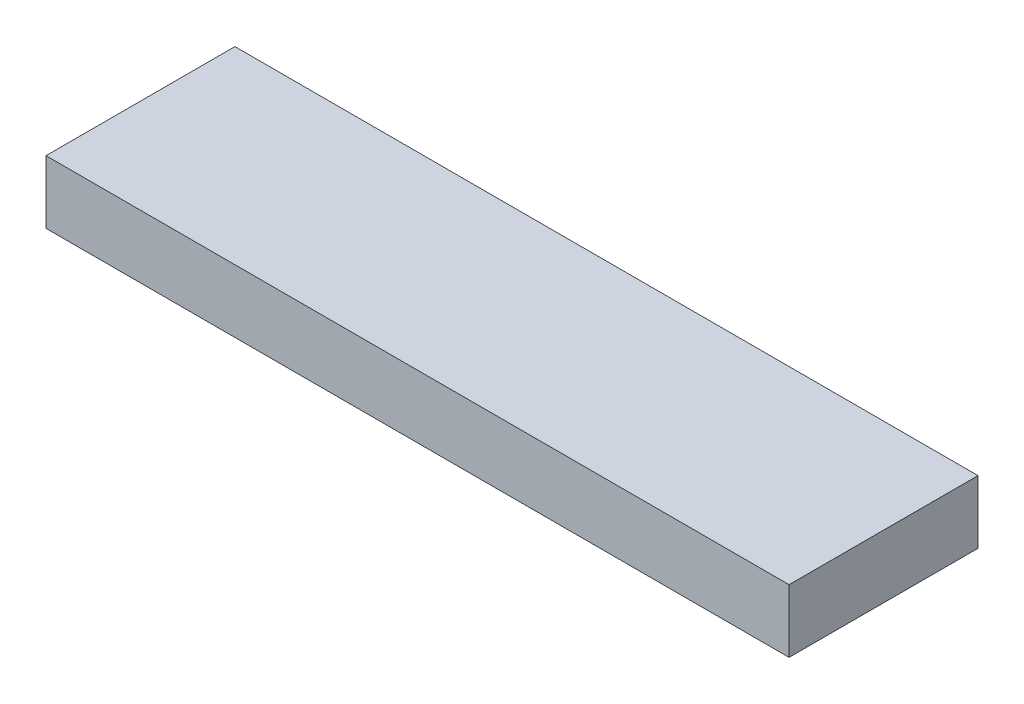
ISO-10303-21;
HEADER;
FILE_DESCRIPTION(('STEP AP214'),'2;1');
FILE_NAME('part.step','',(''),(''),'','','');
FILE_SCHEMA(('AUTOMOTIVE_DESIGN { 1 0 10303 214 1 1 1 1 }'));
ENDSEC;
DATA;
#1=APPLICATION_CONTEXT('core data for automotive mechanical design processes');
#2=APPLICATION_PROTOCOL_DEFINITION('international standard','automotive_design',2000,#1);
#3=PRODUCT_CONTEXT('',#1,'mechanical');
#4=PRODUCT('Part','Part','',(#3));
#5=PRODUCT_RELATED_PRODUCT_CATEGORY('part','',(#4));
#6=PRODUCT_DEFINITION_FORMATION('','',#4);
#7=PRODUCT_DEFINITION_CONTEXT('part definition',#1,'design');
#8=PRODUCT_DEFINITION('design','',#6,#7);
#9=PRODUCT_DEFINITION_SHAPE('','',#8);
#10=(LENGTH_UNIT() NAMED_UNIT(*) SI_UNIT(.MILLI.,.METRE.));
#11=(NAMED_UNIT(*) PLANE_ANGLE_UNIT() SI_UNIT($,.RADIAN.));
#12=(NAMED_UNIT(*) SI_UNIT($,.STERADIAN.) SOLID_ANGLE_UNIT());
#13=UNCERTAINTY_MEASURE_WITH_UNIT(LENGTH_MEASURE(1.E-05),#10,'distance_accuracy_value','');
#14=(GEOMETRIC_REPRESENTATION_CONTEXT(3) GLOBAL_UNCERTAINTY_ASSIGNED_CONTEXT((#13)) GLOBAL_UNIT_ASSIGNED_CONTEXT((#10,
#11,#12)) REPRESENTATION_CONTEXT('',''));
#15=CARTESIAN_POINT('',(0.,0.,0.));
#16=DIRECTION('',(0.,0.,1.));
#17=DIRECTION('',(1.,0.,0.));
#18=AXIS2_PLACEMENT_3D('',#15,#16,#17);
#19=CARTESIAN_POINT('',(-118.,10.,-30.));
#20=DIRECTION('',(0.,0.,-1.));
#21=DIRECTION('',(-1.,0.,0.));
#22=AXIS2_PLACEMENT_3D('',#19,#20,#21);
#23=PLANE('',#22);
#24=DIRECTION('',(1.,0.,0.));
#25=VECTOR('',#24,1.);
#26=CARTESIAN_POINT('',(-118.,-10.,-30.));
#27=LINE('',#26,#25);
#28=CARTESIAN_POINT('',(-118.,-10.,-30.));
#29=VERTEX_POINT('',#28);
#30=CARTESIAN_POINT('',(118.,-10.,-30.));
#31=VERTEX_POINT('',#30);
#32=EDGE_CURVE('E97',#29,#31,#27,.T.);
#33=ORIENTED_EDGE('',*,*,#32,.F.);
#34=DIRECTION('',(0.,-1.,0.));
#35=VECTOR('',#34,1.);
#36=CARTESIAN_POINT('',(-118.,10.,-30.));
#37=LINE('',#36,#35);
#38=CARTESIAN_POINT('',(-118.,10.,-30.));
#39=VERTEX_POINT('',#38);
#40=EDGE_CURVE('E11',#39,#29,#37,.T.);
#41=ORIENTED_EDGE('',*,*,#40,.F.);
#42=DIRECTION('',(1.,0.,0.));
#43=VECTOR('',#42,1.);
#44=CARTESIAN_POINT('',(-118.,10.,-30.));
#45=LINE('',#44,#43);
#46=CARTESIAN_POINT('',(118.,10.,-30.));
#47=VERTEX_POINT('',#46);
#48=EDGE_CURVE('E91',#39,#47,#45,.T.);
#49=ORIENTED_EDGE('',*,*,#48,.T.);
#50=DIRECTION('',(0.,-1.,0.));
#51=VECTOR('',#50,1.);
#52=CARTESIAN_POINT('',(118.,10.,-30.));
#53=LINE('',#52,#51);
#54=EDGE_CURVE('E36',#47,#31,#53,.T.);
#55=ORIENTED_EDGE('',*,*,#54,.T.);
#56=EDGE_LOOP('',(#33,#41,#49,#55));
#57=FACE_BOUND('',#56,.T.);
#58=ADVANCED_FACE('F33',(#57),#23,.T.);
#59=CARTESIAN_POINT('',(-118.,10.,30.));
#60=DIRECTION('',(-1.,0.,0.));
#61=DIRECTION('',(0.,0.,1.));
#62=AXIS2_PLACEMENT_3D('',#59,#60,#61);
#63=PLANE('',#62);
#64=DIRECTION('',(0.,0.,-1.));
#65=VECTOR('',#64,1.);
#66=CARTESIAN_POINT('',(-118.,-10.,30.));
#67=LINE('',#66,#65);
#68=CARTESIAN_POINT('',(-118.,-10.,30.));
#69=VERTEX_POINT('',#68);
#70=EDGE_CURVE('E93',#69,#29,#67,.T.);
#71=ORIENTED_EDGE('',*,*,#70,.F.);
#72=DIRECTION('',(0.,-1.,0.));
#73=VECTOR('',#72,1.);
#74=CARTESIAN_POINT('',(-118.,10.,30.));
#75=LINE('',#74,#73);
#76=CARTESIAN_POINT('',(-118.,10.,30.));
#77=VERTEX_POINT('',#76);
#78=EDGE_CURVE('E42',#77,#69,#75,.T.);
#79=ORIENTED_EDGE('',*,*,#78,.F.);
#80=DIRECTION('',(0.,0.,-1.));
#81=VECTOR('',#80,1.);
#82=CARTESIAN_POINT('',(-118.,10.,30.));
#83=LINE('',#82,#81);
#84=EDGE_CURVE('E88',#77,#39,#83,.T.);
#85=ORIENTED_EDGE('',*,*,#84,.T.);
#86=ORIENTED_EDGE('',*,*,#40,.T.);
#87=EDGE_LOOP('',(#71,#79,#85,#86));
#88=FACE_BOUND('',#87,.T.);
#89=ADVANCED_FACE('F107',(#88),#63,.T.);
#90=CARTESIAN_POINT('',(118.,10.,30.));
#91=DIRECTION('',(0.,0.,1.));
#92=DIRECTION('',(1.,0.,0.));
#93=AXIS2_PLACEMENT_3D('',#90,#91,#92);
#94=PLANE('',#93);
#95=DIRECTION('',(-1.,0.,0.));
#96=VECTOR('',#95,1.);
#97=CARTESIAN_POINT('',(118.,-10.,30.));
#98=LINE('',#97,#96);
#99=CARTESIAN_POINT('',(118.,-10.,30.));
#100=VERTEX_POINT('',#99);
#101=EDGE_CURVE('E83',#100,#69,#98,.T.);
#102=ORIENTED_EDGE('',*,*,#101,.F.);
#103=DIRECTION('',(0.,-1.,0.));
#104=VECTOR('',#103,1.);
#105=CARTESIAN_POINT('',(118.,10.,30.));
#106=LINE('',#105,#104);
#107=CARTESIAN_POINT('',(118.,10.,30.));
#108=VERTEX_POINT('',#107);
#109=EDGE_CURVE('E78',#108,#100,#106,.T.);
#110=ORIENTED_EDGE('',*,*,#109,.F.);
#111=DIRECTION('',(-1.,0.,0.));
#112=VECTOR('',#111,1.);
#113=CARTESIAN_POINT('',(118.,10.,30.));
#114=LINE('',#113,#112);
#115=EDGE_CURVE('E81',#108,#77,#114,.T.);
#116=ORIENTED_EDGE('',*,*,#115,.T.);
#117=ORIENTED_EDGE('',*,*,#78,.T.);
#118=EDGE_LOOP('',(#102,#110,#116,#117));
#119=FACE_BOUND('',#118,.T.);
#120=ADVANCED_FACE('F80',(#119),#94,.T.);
#121=CARTESIAN_POINT('',(118.,10.,-30.));
#122=DIRECTION('',(1.,0.,0.));
#123=DIRECTION('',(0.,0.,-1.));
#124=AXIS2_PLACEMENT_3D('',#121,#122,#123);
#125=PLANE('',#124);
#126=DIRECTION('',(0.,0.,1.));
#127=VECTOR('',#126,1.);
#128=CARTESIAN_POINT('',(118.,-10.,-30.));
#129=LINE('',#128,#127);
#130=EDGE_CURVE('E100',#31,#100,#129,.T.);
#131=ORIENTED_EDGE('',*,*,#130,.F.);
#132=ORIENTED_EDGE('',*,*,#54,.F.);
#133=DIRECTION('',(0.,0.,1.));
#134=VECTOR('',#133,1.);
#135=CARTESIAN_POINT('',(118.,10.,-30.));
#136=LINE('',#135,#134);
#137=EDGE_CURVE('E87',#47,#108,#136,.T.);
#138=ORIENTED_EDGE('',*,*,#137,.T.);
#139=ORIENTED_EDGE('',*,*,#109,.T.);
#140=EDGE_LOOP('',(#131,#132,#138,#139));
#141=FACE_BOUND('',#140,.T.);
#142=ADVANCED_FACE('F90',(#141),#125,.T.);
#143=CARTESIAN_POINT('',(118.,10.,-30.));
#144=DIRECTION('',(0.,-1.,0.));
#145=DIRECTION('',(0.,0.,-1.));
#146=AXIS2_PLACEMENT_3D('',#143,#144,#145);
#147=PLANE('',#146);
#148=ORIENTED_EDGE('',*,*,#48,.F.);
#149=ORIENTED_EDGE('',*,*,#84,.F.);
#150=ORIENTED_EDGE('',*,*,#115,.F.);
#151=ORIENTED_EDGE('',*,*,#137,.F.);
#152=EDGE_LOOP('',(#148,#149,#150,#151));
#153=FACE_BOUND('',#152,.T.);
#154=ADVANCED_FACE('F86',(#153),#147,.F.);
#155=CARTESIAN_POINT('',(118.,-10.,-30.));
#156=DIRECTION('',(0.,-1.,0.));
#157=DIRECTION('',(0.,0.,-1.));
#158=AXIS2_PLACEMENT_3D('',#155,#156,#157);
#159=PLANE('',#158);
#160=ORIENTED_EDGE('',*,*,#32,.T.);
#161=ORIENTED_EDGE('',*,*,#130,.T.);
#162=ORIENTED_EDGE('',*,*,#101,.T.);
#163=ORIENTED_EDGE('',*,*,#70,.T.);
#164=EDGE_LOOP('',(#160,#161,#162,#163));
#165=FACE_BOUND('',#164,.T.);
#166=ADVANCED_FACE('F106',(#165),#159,.T.);
#167=CLOSED_SHELL('',(#58,#89,#120,#142,#154,#166));
#168=MANIFOLD_SOLID_BREP('B2',#167);
#169=ADVANCED_BREP_SHAPE_REPRESENTATION('',(#18,#168),#14);
#170=SHAPE_DEFINITION_REPRESENTATION(#9,#169);
ENDSEC;
END-ISO-10303-21;
